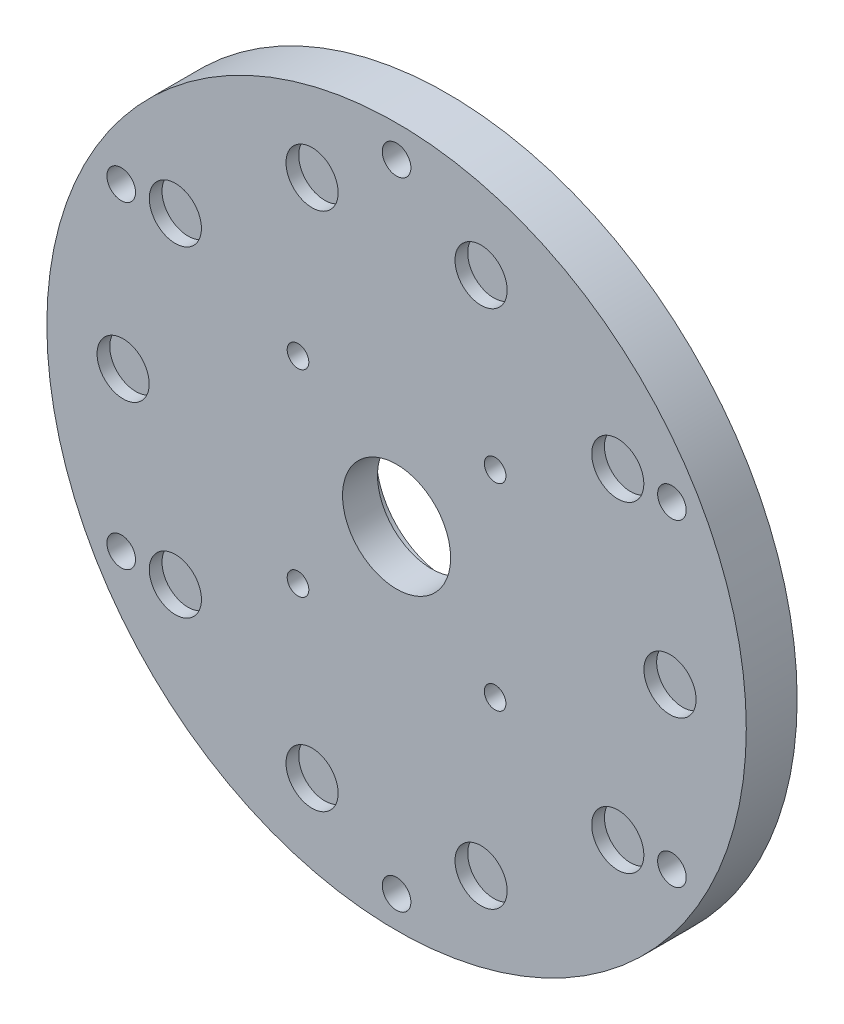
ISO-10303-21;
HEADER;
FILE_DESCRIPTION(('STEP AP214'),'2;1');
FILE_NAME('part.step','',(''),(''),'','','');
FILE_SCHEMA(('AUTOMOTIVE_DESIGN { 1 0 10303 214 1 1 1 1 }'));
ENDSEC;
DATA;
#1=APPLICATION_CONTEXT('core data for automotive mechanical design processes');
#2=APPLICATION_PROTOCOL_DEFINITION('international standard','automotive_design',2000,#1);
#3=PRODUCT_CONTEXT('',#1,'mechanical');
#4=PRODUCT('Part','Part','',(#3));
#5=PRODUCT_RELATED_PRODUCT_CATEGORY('part','',(#4));
#6=PRODUCT_DEFINITION_FORMATION('','',#4);
#7=PRODUCT_DEFINITION_CONTEXT('part definition',#1,'design');
#8=PRODUCT_DEFINITION('design','',#6,#7);
#9=PRODUCT_DEFINITION_SHAPE('','',#8);
#10=(LENGTH_UNIT() NAMED_UNIT(*) SI_UNIT(.MILLI.,.METRE.));
#11=(NAMED_UNIT(*) PLANE_ANGLE_UNIT() SI_UNIT($,.RADIAN.));
#12=(NAMED_UNIT(*) SI_UNIT($,.STERADIAN.) SOLID_ANGLE_UNIT());
#13=UNCERTAINTY_MEASURE_WITH_UNIT(LENGTH_MEASURE(1.E-05),#10,'distance_accuracy_value','');
#14=(GEOMETRIC_REPRESENTATION_CONTEXT(3) GLOBAL_UNCERTAINTY_ASSIGNED_CONTEXT((#13)) GLOBAL_UNIT_ASSIGNED_CONTEXT((#10,
#11,#12)) REPRESENTATION_CONTEXT('',''));
#15=CARTESIAN_POINT('',(0.,0.,0.));
#16=DIRECTION('',(0.,0.,1.));
#17=DIRECTION('',(1.,0.,0.));
#18=AXIS2_PLACEMENT_3D('',#15,#16,#17);
#19=CARTESIAN_POINT('',(43.,0.,6.));
#20=DIRECTION('',(0.,0.,1.));
#21=DIRECTION('',(1.,0.,0.));
#22=AXIS2_PLACEMENT_3D('',#19,#20,#21);
#23=PLANE('',#22);
#24=CARTESIAN_POINT('',(13.287730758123,40.895430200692,6.));
#25=DIRECTION('',(0.,0.,1.));
#26=DIRECTION('',(1.,0.,0.));
#27=AXIS2_PLACEMENT_3D('',#24,#25,#26);
#28=CIRCLE('',#27,4.1);
#29=CARTESIAN_POINT('',(17.387730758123,40.895430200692,6.));
#30=VERTEX_POINT('',#29);
#31=EDGE_CURVE('E9',#30,#30,#28,.T.);
#32=ORIENTED_EDGE('',*,*,#31,.T.);
#33=EDGE_LOOP('',(#32));
#34=FACE_BOUND('',#33,.T.);
#35=ADVANCED_FACE('F14',(#34),#23,.T.);
#36=CARTESIAN_POINT('',(43.,0.,6.));
#37=DIRECTION('',(0.,0.,1.));
#38=DIRECTION('',(1.,0.,0.));
#39=AXIS2_PLACEMENT_3D('',#36,#37,#38);
#40=PLANE('',#39);
#41=CARTESIAN_POINT('',(34.787730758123,25.274765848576,6.));
#42=DIRECTION('',(0.,0.,1.));
#43=DIRECTION('',(1.,0.,0.));
#44=AXIS2_PLACEMENT_3D('',#41,#42,#43);
#45=CIRCLE('',#44,4.1);
#46=CARTESIAN_POINT('',(38.887730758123,25.274765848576,6.));
#47=VERTEX_POINT('',#46);
#48=EDGE_CURVE('E21',#47,#47,#45,.T.);
#49=ORIENTED_EDGE('',*,*,#48,.T.);
#50=EDGE_LOOP('',(#49));
#51=FACE_BOUND('',#50,.T.);
#52=ADVANCED_FACE('F277',(#51),#40,.T.);
#53=CARTESIAN_POINT('',(43.,0.,6.));
#54=DIRECTION('',(0.,0.,1.));
#55=DIRECTION('',(1.,0.,0.));
#56=AXIS2_PLACEMENT_3D('',#53,#54,#55);
#57=PLANE('',#56);
#58=CARTESIAN_POINT('',(43.,0.,6.));
#59=DIRECTION('',(0.,0.,1.));
#60=DIRECTION('',(1.,0.,0.));
#61=AXIS2_PLACEMENT_3D('',#58,#59,#60);
#62=CIRCLE('',#61,4.1);
#63=CARTESIAN_POINT('',(47.1,0.,6.));
#64=VERTEX_POINT('',#63);
#65=EDGE_CURVE('E26',#64,#64,#62,.T.);
#66=ORIENTED_EDGE('',*,*,#65,.T.);
#67=EDGE_LOOP('',(#66));
#68=FACE_BOUND('',#67,.T.);
#69=ADVANCED_FACE('F278',(#68),#57,.T.);
#70=CARTESIAN_POINT('',(43.,0.,6.));
#71=DIRECTION('',(0.,0.,1.));
#72=DIRECTION('',(1.,0.,0.));
#73=AXIS2_PLACEMENT_3D('',#70,#71,#72);
#74=PLANE('',#73);
#75=CARTESIAN_POINT('',(-13.28773075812,40.895430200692,6.));
#76=DIRECTION('',(0.,0.,1.));
#77=DIRECTION('',(1.,0.,0.));
#78=AXIS2_PLACEMENT_3D('',#75,#76,#77);
#79=CIRCLE('',#78,4.1);
#80=CARTESIAN_POINT('',(-9.18773075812,40.895430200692,6.));
#81=VERTEX_POINT('',#80);
#82=EDGE_CURVE('E39',#81,#81,#79,.T.);
#83=ORIENTED_EDGE('',*,*,#82,.T.);
#84=EDGE_LOOP('',(#83));
#85=FACE_BOUND('',#84,.T.);
#86=ADVANCED_FACE('F283',(#85),#74,.T.);
#87=CARTESIAN_POINT('',(43.,0.,6.));
#88=DIRECTION('',(0.,0.,1.));
#89=DIRECTION('',(1.,0.,0.));
#90=AXIS2_PLACEMENT_3D('',#87,#88,#89);
#91=PLANE('',#90);
#92=CARTESIAN_POINT('',(-34.78773075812,25.274765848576,6.));
#93=DIRECTION('',(0.,0.,1.));
#94=DIRECTION('',(1.,0.,0.));
#95=AXIS2_PLACEMENT_3D('',#92,#93,#94);
#96=CIRCLE('',#95,4.1);
#97=CARTESIAN_POINT('',(-30.68773075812,25.274765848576,6.));
#98=VERTEX_POINT('',#97);
#99=EDGE_CURVE('E45',#98,#98,#96,.T.);
#100=ORIENTED_EDGE('',*,*,#99,.T.);
#101=EDGE_LOOP('',(#100));
#102=FACE_BOUND('',#101,.T.);
#103=ADVANCED_FACE('F289',(#102),#91,.T.);
#104=CARTESIAN_POINT('',(43.,0.,6.));
#105=DIRECTION('',(0.,0.,1.));
#106=DIRECTION('',(1.,0.,0.));
#107=AXIS2_PLACEMENT_3D('',#104,#105,#106);
#108=PLANE('',#107);
#109=CARTESIAN_POINT('',(-43.,0.,6.));
#110=DIRECTION('',(0.,0.,1.));
#111=DIRECTION('',(1.,0.,0.));
#112=AXIS2_PLACEMENT_3D('',#109,#110,#111);
#113=CIRCLE('',#112,4.1);
#114=CARTESIAN_POINT('',(-38.9,0.,6.));
#115=VERTEX_POINT('',#114);
#116=EDGE_CURVE('E46',#115,#115,#113,.T.);
#117=ORIENTED_EDGE('',*,*,#116,.T.);
#118=EDGE_LOOP('',(#117));
#119=FACE_BOUND('',#118,.T.);
#120=ADVANCED_FACE('F292',(#119),#108,.T.);
#121=CARTESIAN_POINT('',(43.,0.,6.));
#122=DIRECTION('',(0.,0.,1.));
#123=DIRECTION('',(1.,0.,0.));
#124=AXIS2_PLACEMENT_3D('',#121,#122,#123);
#125=PLANE('',#124);
#126=CARTESIAN_POINT('',(34.787730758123,-25.27476584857,6.));
#127=DIRECTION('',(0.,0.,1.));
#128=DIRECTION('',(1.,0.,0.));
#129=AXIS2_PLACEMENT_3D('',#126,#127,#128);
#130=CIRCLE('',#129,4.1);
#131=CARTESIAN_POINT('',(38.887730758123,-25.27476584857,6.));
#132=VERTEX_POINT('',#131);
#133=EDGE_CURVE('E49',#132,#132,#130,.T.);
#134=ORIENTED_EDGE('',*,*,#133,.T.);
#135=EDGE_LOOP('',(#134));
#136=FACE_BOUND('',#135,.T.);
#137=ADVANCED_FACE('F299',(#136),#125,.T.);
#138=CARTESIAN_POINT('',(43.,0.,6.));
#139=DIRECTION('',(0.,0.,1.));
#140=DIRECTION('',(1.,0.,0.));
#141=AXIS2_PLACEMENT_3D('',#138,#139,#140);
#142=PLANE('',#141);
#143=CARTESIAN_POINT('',(13.287730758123,-40.89543020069,6.));
#144=DIRECTION('',(0.,0.,1.));
#145=DIRECTION('',(1.,0.,0.));
#146=AXIS2_PLACEMENT_3D('',#143,#144,#145);
#147=CIRCLE('',#146,4.1);
#148=CARTESIAN_POINT('',(17.387730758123,-40.89543020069,6.));
#149=VERTEX_POINT('',#148);
#150=EDGE_CURVE('E51',#149,#149,#147,.T.);
#151=ORIENTED_EDGE('',*,*,#150,.T.);
#152=EDGE_LOOP('',(#151));
#153=FACE_BOUND('',#152,.T.);
#154=ADVANCED_FACE('F296',(#153),#142,.T.);
#155=CARTESIAN_POINT('',(43.,0.,6.));
#156=DIRECTION('',(0.,0.,1.));
#157=DIRECTION('',(1.,0.,0.));
#158=AXIS2_PLACEMENT_3D('',#155,#156,#157);
#159=PLANE('',#158);
#160=CARTESIAN_POINT('',(-34.78773075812,-25.27476584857,6.));
#161=DIRECTION('',(0.,0.,1.));
#162=DIRECTION('',(1.,0.,0.));
#163=AXIS2_PLACEMENT_3D('',#160,#161,#162);
#164=CIRCLE('',#163,4.1);
#165=CARTESIAN_POINT('',(-30.68773075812,-25.27476584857,6.));
#166=VERTEX_POINT('',#165);
#167=EDGE_CURVE('E54',#166,#166,#164,.T.);
#168=ORIENTED_EDGE('',*,*,#167,.T.);
#169=EDGE_LOOP('',(#168));
#170=FACE_BOUND('',#169,.T.);
#171=ADVANCED_FACE('F298',(#170),#159,.T.);
#172=CARTESIAN_POINT('',(43.,0.,6.));
#173=DIRECTION('',(0.,0.,1.));
#174=DIRECTION('',(1.,0.,0.));
#175=AXIS2_PLACEMENT_3D('',#172,#173,#174);
#176=PLANE('',#175);
#177=CARTESIAN_POINT('',(-13.28773075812,-40.89543020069,6.));
#178=DIRECTION('',(0.,0.,1.));
#179=DIRECTION('',(1.,0.,0.));
#180=AXIS2_PLACEMENT_3D('',#177,#178,#179);
#181=CIRCLE('',#180,4.1);
#182=CARTESIAN_POINT('',(-9.18773075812,-40.89543020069,6.));
#183=VERTEX_POINT('',#182);
#184=EDGE_CURVE('E56',#183,#183,#181,.T.);
#185=ORIENTED_EDGE('',*,*,#184,.T.);
#186=EDGE_LOOP('',(#185));
#187=FACE_BOUND('',#186,.T.);
#188=ADVANCED_FACE('F305',(#187),#176,.T.);
#189=CARTESIAN_POINT('',(0.,0.,2.5));
#190=DIRECTION('',(0.,0.,1.));
#191=DIRECTION('',(1.,0.,0.));
#192=AXIS2_PLACEMENT_3D('',#189,#190,#191);
#193=PLANE('',#192);
#194=CARTESIAN_POINT('',(0.,0.,2.5));
#195=DIRECTION('',(0.,0.,-1.));
#196=DIRECTION('',(1.,0.,0.));
#197=AXIS2_PLACEMENT_3D('',#194,#195,#196);
#198=CIRCLE('',#197,8.5);
#199=CARTESIAN_POINT('',(8.5,0.,2.5));
#200=VERTEX_POINT('',#199);
#201=EDGE_CURVE('E38',#200,#200,#198,.T.);
#202=ORIENTED_EDGE('',*,*,#201,.F.);
#203=EDGE_LOOP('',(#202));
#204=FACE_BOUND('',#203,.T.);
#205=CARTESIAN_POINT('',(0.,0.,2.5));
#206=DIRECTION('',(0.,0.,1.));
#207=DIRECTION('',(1.,0.,0.));
#208=AXIS2_PLACEMENT_3D('',#205,#206,#207);
#209=CIRCLE('',#208,11.2);
#210=CARTESIAN_POINT('',(11.2,0.,2.5));
#211=VERTEX_POINT('',#210);
#212=EDGE_CURVE('E64',#211,#211,#209,.T.);
#213=ORIENTED_EDGE('',*,*,#212,.F.);
#214=EDGE_LOOP('',(#213));
#215=FACE_BOUND('',#214,.T.);
#216=ADVANCED_FACE('F303',(#204,#215),#193,.F.);
#217=CARTESIAN_POINT('',(13.287730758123,40.895430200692,6.));
#218=DIRECTION('',(0.,0.,-1.));
#219=DIRECTION('',(1.,0.,0.));
#220=AXIS2_PLACEMENT_3D('',#217,#218,#219);
#221=CYLINDRICAL_SURFACE('',#220,4.1);
#222=CARTESIAN_POINT('',(13.287730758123,40.895430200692,8.));
#223=DIRECTION('',(0.,0.,1.));
#224=DIRECTION('',(1.,0.,0.));
#225=AXIS2_PLACEMENT_3D('',#222,#223,#224);
#226=CIRCLE('',#225,4.1);
#227=CARTESIAN_POINT('',(17.387730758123,40.895430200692,8.));
#228=VERTEX_POINT('',#227);
#229=EDGE_CURVE('E70',#228,#228,#226,.T.);
#230=ORIENTED_EDGE('',*,*,#229,.T.);
#231=EDGE_LOOP('',(#230));
#232=FACE_BOUND('',#231,.T.);
#233=ORIENTED_EDGE('',*,*,#31,.F.);
#234=EDGE_LOOP('',(#233));
#235=FACE_BOUND('',#234,.T.);
#236=ADVANCED_FACE('F310',(#232,#235),#221,.F.);
#237=CARTESIAN_POINT('',(34.787730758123,25.274765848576,6.));
#238=DIRECTION('',(0.,0.,-1.));
#239=DIRECTION('',(1.,0.,0.));
#240=AXIS2_PLACEMENT_3D('',#237,#238,#239);
#241=CYLINDRICAL_SURFACE('',#240,4.1);
#242=CARTESIAN_POINT('',(34.787730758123,25.274765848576,8.));
#243=DIRECTION('',(0.,0.,1.));
#244=DIRECTION('',(1.,0.,0.));
#245=AXIS2_PLACEMENT_3D('',#242,#243,#244);
#246=CIRCLE('',#245,4.1);
#247=CARTESIAN_POINT('',(38.887730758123,25.274765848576,8.));
#248=VERTEX_POINT('',#247);
#249=EDGE_CURVE('E76',#248,#248,#246,.T.);
#250=ORIENTED_EDGE('',*,*,#249,.T.);
#251=EDGE_LOOP('',(#250));
#252=FACE_BOUND('',#251,.T.);
#253=ORIENTED_EDGE('',*,*,#48,.F.);
#254=EDGE_LOOP('',(#253));
#255=FACE_BOUND('',#254,.T.);
#256=ADVANCED_FACE('F311',(#252,#255),#241,.F.);
#257=CARTESIAN_POINT('',(43.,0.,6.));
#258=DIRECTION('',(0.,0.,-1.));
#259=DIRECTION('',(1.,0.,0.));
#260=AXIS2_PLACEMENT_3D('',#257,#258,#259);
#261=CYLINDRICAL_SURFACE('',#260,4.1);
#262=CARTESIAN_POINT('',(43.,0.,8.));
#263=DIRECTION('',(0.,0.,1.));
#264=DIRECTION('',(1.,0.,0.));
#265=AXIS2_PLACEMENT_3D('',#262,#263,#264);
#266=CIRCLE('',#265,4.1);
#267=CARTESIAN_POINT('',(47.1,0.,8.));
#268=VERTEX_POINT('',#267);
#269=EDGE_CURVE('E79',#268,#268,#266,.T.);
#270=ORIENTED_EDGE('',*,*,#269,.T.);
#271=EDGE_LOOP('',(#270));
#272=FACE_BOUND('',#271,.T.);
#273=ORIENTED_EDGE('',*,*,#65,.F.);
#274=EDGE_LOOP('',(#273));
#275=FACE_BOUND('',#274,.T.);
#276=ADVANCED_FACE('F320',(#272,#275),#261,.F.);
#277=CARTESIAN_POINT('',(0.,0.,0.));
#278=DIRECTION('',(0.,0.,-1.));
#279=DIRECTION('',(1.,0.,0.));
#280=AXIS2_PLACEMENT_3D('',#277,#278,#279);
#281=CYLINDRICAL_SURFACE('',#280,8.5);
#282=CARTESIAN_POINT('',(0.,0.,8.));
#283=DIRECTION('',(0.,0.,1.));
#284=DIRECTION('',(1.,0.,0.));
#285=AXIS2_PLACEMENT_3D('',#282,#283,#284);
#286=CIRCLE('',#285,8.5);
#287=CARTESIAN_POINT('',(8.5,0.,8.));
#288=VERTEX_POINT('',#287);
#289=EDGE_CURVE('E86',#288,#288,#286,.T.);
#290=ORIENTED_EDGE('',*,*,#289,.T.);
#291=EDGE_LOOP('',(#290));
#292=FACE_BOUND('',#291,.T.);
#293=ORIENTED_EDGE('',*,*,#201,.T.);
#294=EDGE_LOOP('',(#293));
#295=FACE_BOUND('',#294,.T.);
#296=ADVANCED_FACE('F321',(#292,#295),#281,.F.);
#297=CARTESIAN_POINT('',(-13.28773075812,40.895430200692,6.));
#298=DIRECTION('',(0.,0.,-1.));
#299=DIRECTION('',(1.,0.,0.));
#300=AXIS2_PLACEMENT_3D('',#297,#298,#299);
#301=CYLINDRICAL_SURFACE('',#300,4.1);
#302=CARTESIAN_POINT('',(-13.28773075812,40.895430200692,8.));
#303=DIRECTION('',(0.,0.,1.));
#304=DIRECTION('',(1.,0.,0.));
#305=AXIS2_PLACEMENT_3D('',#302,#303,#304);
#306=CIRCLE('',#305,4.1);
#307=CARTESIAN_POINT('',(-9.18773075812,40.895430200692,8.));
#308=VERTEX_POINT('',#307);
#309=EDGE_CURVE('E95',#308,#308,#306,.T.);
#310=ORIENTED_EDGE('',*,*,#309,.T.);
#311=EDGE_LOOP('',(#310));
#312=FACE_BOUND('',#311,.T.);
#313=ORIENTED_EDGE('',*,*,#82,.F.);
#314=EDGE_LOOP('',(#313));
#315=FACE_BOUND('',#314,.T.);
#316=ADVANCED_FACE('F324',(#312,#315),#301,.F.);
#317=CARTESIAN_POINT('',(-34.78773075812,25.274765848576,6.));
#318=DIRECTION('',(0.,0.,-1.));
#319=DIRECTION('',(1.,0.,0.));
#320=AXIS2_PLACEMENT_3D('',#317,#318,#319);
#321=CYLINDRICAL_SURFACE('',#320,4.1);
#322=CARTESIAN_POINT('',(-34.78773075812,25.274765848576,8.));
#323=DIRECTION('',(0.,0.,1.));
#324=DIRECTION('',(1.,0.,0.));
#325=AXIS2_PLACEMENT_3D('',#322,#323,#324);
#326=CIRCLE('',#325,4.1);
#327=CARTESIAN_POINT('',(-30.68773075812,25.274765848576,8.));
#328=VERTEX_POINT('',#327);
#329=EDGE_CURVE('E99',#328,#328,#326,.T.);
#330=ORIENTED_EDGE('',*,*,#329,.T.);
#331=EDGE_LOOP('',(#330));
#332=FACE_BOUND('',#331,.T.);
#333=ORIENTED_EDGE('',*,*,#99,.F.);
#334=EDGE_LOOP('',(#333));
#335=FACE_BOUND('',#334,.T.);
#336=ADVANCED_FACE('F328',(#332,#335),#321,.F.);
#337=CARTESIAN_POINT('',(-43.,0.,6.));
#338=DIRECTION('',(0.,0.,-1.));
#339=DIRECTION('',(1.,0.,0.));
#340=AXIS2_PLACEMENT_3D('',#337,#338,#339);
#341=CYLINDRICAL_SURFACE('',#340,4.1);
#342=CARTESIAN_POINT('',(-43.,0.,8.));
#343=DIRECTION('',(0.,0.,1.));
#344=DIRECTION('',(1.,0.,0.));
#345=AXIS2_PLACEMENT_3D('',#342,#343,#344);
#346=CIRCLE('',#345,4.1);
#347=CARTESIAN_POINT('',(-38.9,0.,8.));
#348=VERTEX_POINT('',#347);
#349=EDGE_CURVE('E107',#348,#348,#346,.T.);
#350=ORIENTED_EDGE('',*,*,#349,.T.);
#351=EDGE_LOOP('',(#350));
#352=FACE_BOUND('',#351,.T.);
#353=ORIENTED_EDGE('',*,*,#116,.F.);
#354=EDGE_LOOP('',(#353));
#355=FACE_BOUND('',#354,.T.);
#356=ADVANCED_FACE('F334',(#352,#355),#341,.F.);
#357=CARTESIAN_POINT('',(34.787730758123,-25.27476584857,6.));
#358=DIRECTION('',(0.,0.,-1.));
#359=DIRECTION('',(1.,0.,0.));
#360=AXIS2_PLACEMENT_3D('',#357,#358,#359);
#361=CYLINDRICAL_SURFACE('',#360,4.1);
#362=CARTESIAN_POINT('',(34.787730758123,-25.27476584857,8.));
#363=DIRECTION('',(0.,0.,1.));
#364=DIRECTION('',(1.,0.,0.));
#365=AXIS2_PLACEMENT_3D('',#362,#363,#364);
#366=CIRCLE('',#365,4.1);
#367=CARTESIAN_POINT('',(38.887730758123,-25.27476584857,8.));
#368=VERTEX_POINT('',#367);
#369=EDGE_CURVE('E114',#368,#368,#366,.T.);
#370=ORIENTED_EDGE('',*,*,#369,.T.);
#371=EDGE_LOOP('',(#370));
#372=FACE_BOUND('',#371,.T.);
#373=ORIENTED_EDGE('',*,*,#133,.F.);
#374=EDGE_LOOP('',(#373));
#375=FACE_BOUND('',#374,.T.);
#376=ADVANCED_FACE('F337',(#372,#375),#361,.F.);
#377=CARTESIAN_POINT('',(13.287730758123,-40.89543020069,6.));
#378=DIRECTION('',(0.,0.,-1.));
#379=DIRECTION('',(1.,0.,0.));
#380=AXIS2_PLACEMENT_3D('',#377,#378,#379);
#381=CYLINDRICAL_SURFACE('',#380,4.1);
#382=CARTESIAN_POINT('',(13.287730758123,-40.89543020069,8.));
#383=DIRECTION('',(0.,0.,1.));
#384=DIRECTION('',(1.,0.,0.));
#385=AXIS2_PLACEMENT_3D('',#382,#383,#384);
#386=CIRCLE('',#385,4.1);
#387=CARTESIAN_POINT('',(17.387730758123,-40.89543020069,8.));
#388=VERTEX_POINT('',#387);
#389=EDGE_CURVE('E122',#388,#388,#386,.T.);
#390=ORIENTED_EDGE('',*,*,#389,.T.);
#391=EDGE_LOOP('',(#390));
#392=FACE_BOUND('',#391,.T.);
#393=ORIENTED_EDGE('',*,*,#150,.F.);
#394=EDGE_LOOP('',(#393));
#395=FACE_BOUND('',#394,.T.);
#396=ADVANCED_FACE('F341',(#392,#395),#381,.F.);
#397=CARTESIAN_POINT('',(-34.78773075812,-25.27476584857,6.));
#398=DIRECTION('',(0.,0.,-1.));
#399=DIRECTION('',(1.,0.,0.));
#400=AXIS2_PLACEMENT_3D('',#397,#398,#399);
#401=CYLINDRICAL_SURFACE('',#400,4.1);
#402=CARTESIAN_POINT('',(-34.78773075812,-25.27476584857,8.));
#403=DIRECTION('',(0.,0.,1.));
#404=DIRECTION('',(1.,0.,0.));
#405=AXIS2_PLACEMENT_3D('',#402,#403,#404);
#406=CIRCLE('',#405,4.1);
#407=CARTESIAN_POINT('',(-30.68773075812,-25.27476584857,8.));
#408=VERTEX_POINT('',#407);
#409=EDGE_CURVE('E135',#408,#408,#406,.T.);
#410=ORIENTED_EDGE('',*,*,#409,.T.);
#411=EDGE_LOOP('',(#410));
#412=FACE_BOUND('',#411,.T.);
#413=ORIENTED_EDGE('',*,*,#167,.F.);
#414=EDGE_LOOP('',(#413));
#415=FACE_BOUND('',#414,.T.);
#416=ADVANCED_FACE('F344',(#412,#415),#401,.F.);
#417=CARTESIAN_POINT('',(-13.28773075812,-40.89543020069,6.));
#418=DIRECTION('',(0.,0.,-1.));
#419=DIRECTION('',(1.,0.,0.));
#420=AXIS2_PLACEMENT_3D('',#417,#418,#419);
#421=CYLINDRICAL_SURFACE('',#420,4.1);
#422=CARTESIAN_POINT('',(-13.28773075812,-40.89543020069,8.));
#423=DIRECTION('',(0.,0.,1.));
#424=DIRECTION('',(1.,0.,0.));
#425=AXIS2_PLACEMENT_3D('',#422,#423,#424);
#426=CIRCLE('',#425,4.1);
#427=CARTESIAN_POINT('',(-9.18773075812,-40.89543020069,8.));
#428=VERTEX_POINT('',#427);
#429=EDGE_CURVE('E145',#428,#428,#426,.T.);
#430=ORIENTED_EDGE('',*,*,#429,.T.);
#431=EDGE_LOOP('',(#430));
#432=FACE_BOUND('',#431,.T.);
#433=ORIENTED_EDGE('',*,*,#184,.F.);
#434=EDGE_LOOP('',(#433));
#435=FACE_BOUND('',#434,.T.);
#436=ADVANCED_FACE('F347',(#432,#435),#421,.F.);
#437=CARTESIAN_POINT('',(0.,50.,0.));
#438=DIRECTION('',(0.,0.,-1.));
#439=DIRECTION('',(1.,0.,0.));
#440=AXIS2_PLACEMENT_3D('',#437,#438,#439);
#441=CYLINDRICAL_SURFACE('',#440,2.25);
#442=CARTESIAN_POINT('',(0.,50.,8.));
#443=DIRECTION('',(0.,0.,1.));
#444=DIRECTION('',(1.,0.,0.));
#445=AXIS2_PLACEMENT_3D('',#442,#443,#444);
#446=CIRCLE('',#445,2.25);
#447=CARTESIAN_POINT('',(2.25,50.,8.));
#448=VERTEX_POINT('',#447);
#449=EDGE_CURVE('E75',#448,#448,#446,.T.);
#450=ORIENTED_EDGE('',*,*,#449,.T.);
#451=EDGE_LOOP('',(#450));
#452=FACE_BOUND('',#451,.T.);
#453=CARTESIAN_POINT('',(0.,50.,0.));
#454=DIRECTION('',(0.,0.,1.));
#455=DIRECTION('',(1.,0.,0.));
#456=AXIS2_PLACEMENT_3D('',#453,#454,#455);
#457=CIRCLE('',#456,2.25);
#458=CARTESIAN_POINT('',(2.25,50.,0.));
#459=VERTEX_POINT('',#458);
#460=EDGE_CURVE('E150',#459,#459,#457,.T.);
#461=ORIENTED_EDGE('',*,*,#460,.F.);
#462=EDGE_LOOP('',(#461));
#463=FACE_BOUND('',#462,.T.);
#464=ADVANCED_FACE('F211',(#452,#463),#441,.F.);
#465=CARTESIAN_POINT('',(43.301270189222,25.,0.));
#466=DIRECTION('',(0.,0.,-1.));
#467=DIRECTION('',(1.,0.,0.));
#468=AXIS2_PLACEMENT_3D('',#465,#466,#467);
#469=CYLINDRICAL_SURFACE('',#468,2.25);
#470=CARTESIAN_POINT('',(43.301270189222,25.,8.));
#471=DIRECTION('',(0.,0.,1.));
#472=DIRECTION('',(1.,0.,0.));
#473=AXIS2_PLACEMENT_3D('',#470,#471,#472);
#474=CIRCLE('',#473,2.25);
#475=CARTESIAN_POINT('',(45.551270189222,25.,8.));
#476=VERTEX_POINT('',#475);
#477=EDGE_CURVE('E71',#476,#476,#474,.T.);
#478=ORIENTED_EDGE('',*,*,#477,.T.);
#479=EDGE_LOOP('',(#478));
#480=FACE_BOUND('',#479,.T.);
#481=CARTESIAN_POINT('',(43.301270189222,25.,0.));
#482=DIRECTION('',(0.,0.,1.));
#483=DIRECTION('',(1.,0.,0.));
#484=AXIS2_PLACEMENT_3D('',#481,#482,#483);
#485=CIRCLE('',#484,2.25);
#486=CARTESIAN_POINT('',(45.551270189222,25.,0.));
#487=VERTEX_POINT('',#486);
#488=EDGE_CURVE('E155',#487,#487,#485,.T.);
#489=ORIENTED_EDGE('',*,*,#488,.F.);
#490=EDGE_LOOP('',(#489));
#491=FACE_BOUND('',#490,.T.);
#492=ADVANCED_FACE('F353',(#480,#491),#469,.F.);
#493=CARTESIAN_POINT('',(15.5,15.5,0.));
#494=DIRECTION('',(0.,0.,-1.));
#495=DIRECTION('',(1.,0.,0.));
#496=AXIS2_PLACEMENT_3D('',#493,#494,#495);
#497=CYLINDRICAL_SURFACE('',#496,1.7);
#498=CARTESIAN_POINT('',(15.5,15.5,8.));
#499=DIRECTION('',(0.,0.,1.));
#500=DIRECTION('',(1.,0.,0.));
#501=AXIS2_PLACEMENT_3D('',#498,#499,#500);
#502=CIRCLE('',#501,1.7);
#503=CARTESIAN_POINT('',(17.2,15.5,8.));
#504=VERTEX_POINT('',#503);
#505=EDGE_CURVE('E81',#504,#504,#502,.T.);
#506=ORIENTED_EDGE('',*,*,#505,.T.);
#507=EDGE_LOOP('',(#506));
#508=FACE_BOUND('',#507,.T.);
#509=CARTESIAN_POINT('',(15.5,15.5,0.));
#510=DIRECTION('',(0.,0.,1.));
#511=DIRECTION('',(1.,0.,0.));
#512=AXIS2_PLACEMENT_3D('',#509,#510,#511);
#513=CIRCLE('',#512,1.7);
#514=CARTESIAN_POINT('',(17.2,15.5,0.));
#515=VERTEX_POINT('',#514);
#516=EDGE_CURVE('E156',#515,#515,#513,.T.);
#517=ORIENTED_EDGE('',*,*,#516,.F.);
#518=EDGE_LOOP('',(#517));
#519=FACE_BOUND('',#518,.T.);
#520=ADVANCED_FACE('F360',(#508,#519),#497,.F.);
#521=CARTESIAN_POINT('',(0.,0.,0.));
#522=DIRECTION('',(0.,0.,-1.));
#523=DIRECTION('',(1.,0.,0.));
#524=AXIS2_PLACEMENT_3D('',#521,#522,#523);
#525=CYLINDRICAL_SURFACE('',#524,11.2);
#526=ORIENTED_EDGE('',*,*,#212,.T.);
#527=EDGE_LOOP('',(#526));
#528=FACE_BOUND('',#527,.T.);
#529=CARTESIAN_POINT('',(0.,0.,0.));
#530=DIRECTION('',(0.,0.,1.));
#531=DIRECTION('',(1.,0.,0.));
#532=AXIS2_PLACEMENT_3D('',#529,#530,#531);
#533=CIRCLE('',#532,11.2);
#534=CARTESIAN_POINT('',(11.2,0.,0.));
#535=VERTEX_POINT('',#534);
#536=EDGE_CURVE('E161',#535,#535,#533,.T.);
#537=ORIENTED_EDGE('',*,*,#536,.F.);
#538=EDGE_LOOP('',(#537));
#539=FACE_BOUND('',#538,.T.);
#540=ADVANCED_FACE('F363',(#528,#539),#525,.F.);
#541=CARTESIAN_POINT('',(-15.5,15.5,0.));
#542=DIRECTION('',(0.,0.,-1.));
#543=DIRECTION('',(1.,0.,0.));
#544=AXIS2_PLACEMENT_3D('',#541,#542,#543);
#545=CYLINDRICAL_SURFACE('',#544,1.7);
#546=CARTESIAN_POINT('',(-15.5,15.5,8.));
#547=DIRECTION('',(0.,0.,1.));
#548=DIRECTION('',(1.,0.,0.));
#549=AXIS2_PLACEMENT_3D('',#546,#547,#548);
#550=CIRCLE('',#549,1.7);
#551=CARTESIAN_POINT('',(-13.8,15.5,8.));
#552=VERTEX_POINT('',#551);
#553=EDGE_CURVE('E96',#552,#552,#550,.T.);
#554=ORIENTED_EDGE('',*,*,#553,.T.);
#555=EDGE_LOOP('',(#554));
#556=FACE_BOUND('',#555,.T.);
#557=CARTESIAN_POINT('',(-15.5,15.5,0.));
#558=DIRECTION('',(0.,0.,1.));
#559=DIRECTION('',(1.,0.,0.));
#560=AXIS2_PLACEMENT_3D('',#557,#558,#559);
#561=CIRCLE('',#560,1.7);
#562=CARTESIAN_POINT('',(-13.8,15.5,0.));
#563=VERTEX_POINT('',#562);
#564=EDGE_CURVE('E160',#563,#563,#561,.T.);
#565=ORIENTED_EDGE('',*,*,#564,.F.);
#566=EDGE_LOOP('',(#565));
#567=FACE_BOUND('',#566,.T.);
#568=ADVANCED_FACE('F366',(#556,#567),#545,.F.);
#569=CARTESIAN_POINT('',(-43.30127018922,25.,0.));
#570=DIRECTION('',(0.,0.,-1.));
#571=DIRECTION('',(1.,0.,0.));
#572=AXIS2_PLACEMENT_3D('',#569,#570,#571);
#573=CYLINDRICAL_SURFACE('',#572,2.25);
#574=CARTESIAN_POINT('',(-43.30127018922,25.,8.));
#575=DIRECTION('',(0.,0.,1.));
#576=DIRECTION('',(1.,0.,0.));
#577=AXIS2_PLACEMENT_3D('',#574,#575,#576);
#578=CIRCLE('',#577,2.25);
#579=CARTESIAN_POINT('',(-41.05127018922,25.,8.));
#580=VERTEX_POINT('',#579);
#581=EDGE_CURVE('E102',#580,#580,#578,.T.);
#582=ORIENTED_EDGE('',*,*,#581,.T.);
#583=EDGE_LOOP('',(#582));
#584=FACE_BOUND('',#583,.T.);
#585=CARTESIAN_POINT('',(-43.30127018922,25.,0.));
#586=DIRECTION('',(0.,0.,1.));
#587=DIRECTION('',(1.,0.,0.));
#588=AXIS2_PLACEMENT_3D('',#585,#586,#587);
#589=CIRCLE('',#588,2.25);
#590=CARTESIAN_POINT('',(-41.05127018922,25.,0.));
#591=VERTEX_POINT('',#590);
#592=EDGE_CURVE('E165',#591,#591,#589,.T.);
#593=ORIENTED_EDGE('',*,*,#592,.F.);
#594=EDGE_LOOP('',(#593));
#595=FACE_BOUND('',#594,.T.);
#596=ADVANCED_FACE('F375',(#584,#595),#573,.F.);
#597=CARTESIAN_POINT('',(43.301270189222,-25.,0.));
#598=DIRECTION('',(0.,0.,-1.));
#599=DIRECTION('',(1.,0.,0.));
#600=AXIS2_PLACEMENT_3D('',#597,#598,#599);
#601=CYLINDRICAL_SURFACE('',#600,2.25);
#602=CARTESIAN_POINT('',(43.301270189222,-25.,8.));
#603=DIRECTION('',(0.,0.,1.));
#604=DIRECTION('',(1.,0.,0.));
#605=AXIS2_PLACEMENT_3D('',#602,#603,#604);
#606=CIRCLE('',#605,2.25);
#607=CARTESIAN_POINT('',(45.551270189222,-25.,8.));
#608=VERTEX_POINT('',#607);
#609=EDGE_CURVE('E108',#608,#608,#606,.T.);
#610=ORIENTED_EDGE('',*,*,#609,.T.);
#611=EDGE_LOOP('',(#610));
#612=FACE_BOUND('',#611,.T.);
#613=CARTESIAN_POINT('',(43.301270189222,-25.,0.));
#614=DIRECTION('',(0.,0.,1.));
#615=DIRECTION('',(1.,0.,0.));
#616=AXIS2_PLACEMENT_3D('',#613,#614,#615);
#617=CIRCLE('',#616,2.25);
#618=CARTESIAN_POINT('',(45.551270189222,-25.,0.));
#619=VERTEX_POINT('',#618);
#620=EDGE_CURVE('E162',#619,#619,#617,.T.);
#621=ORIENTED_EDGE('',*,*,#620,.F.);
#622=EDGE_LOOP('',(#621));
#623=FACE_BOUND('',#622,.T.);
#624=ADVANCED_FACE('F376',(#612,#623),#601,.F.);
#625=CARTESIAN_POINT('',(15.5,-15.5,0.));
#626=DIRECTION('',(0.,0.,-1.));
#627=DIRECTION('',(1.,0.,0.));
#628=AXIS2_PLACEMENT_3D('',#625,#626,#627);
#629=CYLINDRICAL_SURFACE('',#628,1.7);
#630=CARTESIAN_POINT('',(15.5,-15.5,8.));
#631=DIRECTION('',(0.,0.,1.));
#632=DIRECTION('',(1.,0.,0.));
#633=AXIS2_PLACEMENT_3D('',#630,#631,#632);
#634=CIRCLE('',#633,1.7);
#635=CARTESIAN_POINT('',(17.2,-15.5,8.));
#636=VERTEX_POINT('',#635);
#637=EDGE_CURVE('E120',#636,#636,#634,.T.);
#638=ORIENTED_EDGE('',*,*,#637,.T.);
#639=EDGE_LOOP('',(#638));
#640=FACE_BOUND('',#639,.T.);
#641=CARTESIAN_POINT('',(15.5,-15.5,0.));
#642=DIRECTION('',(0.,0.,1.));
#643=DIRECTION('',(1.,0.,0.));
#644=AXIS2_PLACEMENT_3D('',#641,#642,#643);
#645=CIRCLE('',#644,1.7);
#646=CARTESIAN_POINT('',(17.2,-15.5,0.));
#647=VERTEX_POINT('',#646);
#648=EDGE_CURVE('E170',#647,#647,#645,.T.);
#649=ORIENTED_EDGE('',*,*,#648,.F.);
#650=EDGE_LOOP('',(#649));
#651=FACE_BOUND('',#650,.T.);
#652=ADVANCED_FACE('F378',(#640,#651),#629,.F.);
#653=CARTESIAN_POINT('',(-15.5,-15.5,0.));
#654=DIRECTION('',(0.,0.,-1.));
#655=DIRECTION('',(1.,0.,0.));
#656=AXIS2_PLACEMENT_3D('',#653,#654,#655);
#657=CYLINDRICAL_SURFACE('',#656,1.7);
#658=CARTESIAN_POINT('',(-15.5,-15.5,8.));
#659=DIRECTION('',(0.,0.,1.));
#660=DIRECTION('',(1.,0.,0.));
#661=AXIS2_PLACEMENT_3D('',#658,#659,#660);
#662=CIRCLE('',#661,1.7);
#663=CARTESIAN_POINT('',(-13.8,-15.5,8.));
#664=VERTEX_POINT('',#663);
#665=EDGE_CURVE('E128',#664,#664,#662,.T.);
#666=ORIENTED_EDGE('',*,*,#665,.T.);
#667=EDGE_LOOP('',(#666));
#668=FACE_BOUND('',#667,.T.);
#669=CARTESIAN_POINT('',(-15.5,-15.5,0.));
#670=DIRECTION('',(0.,0.,1.));
#671=DIRECTION('',(1.,0.,0.));
#672=AXIS2_PLACEMENT_3D('',#669,#670,#671);
#673=CIRCLE('',#672,1.7);
#674=CARTESIAN_POINT('',(-13.8,-15.5,0.));
#675=VERTEX_POINT('',#674);
#676=EDGE_CURVE('E171',#675,#675,#673,.T.);
#677=ORIENTED_EDGE('',*,*,#676,.F.);
#678=EDGE_LOOP('',(#677));
#679=FACE_BOUND('',#678,.T.);
#680=ADVANCED_FACE('F381',(#668,#679),#657,.F.);
#681=CARTESIAN_POINT('',(-43.30127018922,-25.,0.));
#682=DIRECTION('',(0.,0.,-1.));
#683=DIRECTION('',(1.,0.,0.));
#684=AXIS2_PLACEMENT_3D('',#681,#682,#683);
#685=CYLINDRICAL_SURFACE('',#684,2.25);
#686=CARTESIAN_POINT('',(-43.30127018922,-25.,8.));
#687=DIRECTION('',(0.,0.,1.));
#688=DIRECTION('',(1.,0.,0.));
#689=AXIS2_PLACEMENT_3D('',#686,#687,#688);
#690=CIRCLE('',#689,2.25);
#691=CARTESIAN_POINT('',(-41.05127018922,-25.,8.));
#692=VERTEX_POINT('',#691);
#693=EDGE_CURVE('E137',#692,#692,#690,.T.);
#694=ORIENTED_EDGE('',*,*,#693,.T.);
#695=EDGE_LOOP('',(#694));
#696=FACE_BOUND('',#695,.T.);
#697=CARTESIAN_POINT('',(-43.30127018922,-25.,0.));
#698=DIRECTION('',(0.,0.,1.));
#699=DIRECTION('',(1.,0.,0.));
#700=AXIS2_PLACEMENT_3D('',#697,#698,#699);
#701=CIRCLE('',#700,2.25);
#702=CARTESIAN_POINT('',(-41.05127018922,-25.,0.));
#703=VERTEX_POINT('',#702);
#704=EDGE_CURVE('E175',#703,#703,#701,.T.);
#705=ORIENTED_EDGE('',*,*,#704,.F.);
#706=EDGE_LOOP('',(#705));
#707=FACE_BOUND('',#706,.T.);
#708=ADVANCED_FACE('F384',(#696,#707),#685,.F.);
#709=CARTESIAN_POINT('',(0.,-50.,0.));
#710=DIRECTION('',(0.,0.,-1.));
#711=DIRECTION('',(1.,0.,0.));
#712=AXIS2_PLACEMENT_3D('',#709,#710,#711);
#713=CYLINDRICAL_SURFACE('',#712,2.25);
#714=CARTESIAN_POINT('',(0.,-50.,8.));
#715=DIRECTION('',(0.,0.,1.));
#716=DIRECTION('',(1.,0.,0.));
#717=AXIS2_PLACEMENT_3D('',#714,#715,#716);
#718=CIRCLE('',#717,2.25);
#719=CARTESIAN_POINT('',(2.24999999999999,-50.,8.));
#720=VERTEX_POINT('',#719);
#721=EDGE_CURVE('E138',#720,#720,#718,.T.);
#722=ORIENTED_EDGE('',*,*,#721,.T.);
#723=EDGE_LOOP('',(#722));
#724=FACE_BOUND('',#723,.T.);
#725=CARTESIAN_POINT('',(0.,-50.,0.));
#726=DIRECTION('',(0.,0.,1.));
#727=DIRECTION('',(1.,0.,0.));
#728=AXIS2_PLACEMENT_3D('',#725,#726,#727);
#729=CIRCLE('',#728,2.25);
#730=CARTESIAN_POINT('',(2.24999999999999,-50.,0.));
#731=VERTEX_POINT('',#730);
#732=EDGE_CURVE('E177',#731,#731,#729,.T.);
#733=ORIENTED_EDGE('',*,*,#732,.F.);
#734=EDGE_LOOP('',(#733));
#735=FACE_BOUND('',#734,.T.);
#736=ADVANCED_FACE('F217',(#724,#735),#713,.F.);
#737=CARTESIAN_POINT('',(0.,0.,8.));
#738=DIRECTION('',(0.,0.,1.));
#739=DIRECTION('',(1.,0.,0.));
#740=AXIS2_PLACEMENT_3D('',#737,#738,#739);
#741=PLANE('',#740);
#742=ORIENTED_EDGE('',*,*,#229,.F.);
#743=EDGE_LOOP('',(#742));
#744=FACE_BOUND('',#743,.T.);
#745=ORIENTED_EDGE('',*,*,#449,.F.);
#746=EDGE_LOOP('',(#745));
#747=FACE_BOUND('',#746,.T.);
#748=ORIENTED_EDGE('',*,*,#477,.F.);
#749=EDGE_LOOP('',(#748));
#750=FACE_BOUND('',#749,.T.);
#751=ORIENTED_EDGE('',*,*,#249,.F.);
#752=EDGE_LOOP('',(#751));
#753=FACE_BOUND('',#752,.T.);
#754=ORIENTED_EDGE('',*,*,#269,.F.);
#755=EDGE_LOOP('',(#754));
#756=FACE_BOUND('',#755,.T.);
#757=ORIENTED_EDGE('',*,*,#505,.F.);
#758=EDGE_LOOP('',(#757));
#759=FACE_BOUND('',#758,.T.);
#760=ORIENTED_EDGE('',*,*,#289,.F.);
#761=EDGE_LOOP('',(#760));
#762=FACE_BOUND('',#761,.T.);
#763=ORIENTED_EDGE('',*,*,#309,.F.);
#764=EDGE_LOOP('',(#763));
#765=FACE_BOUND('',#764,.T.);
#766=ORIENTED_EDGE('',*,*,#553,.F.);
#767=EDGE_LOOP('',(#766));
#768=FACE_BOUND('',#767,.T.);
#769=ORIENTED_EDGE('',*,*,#329,.F.);
#770=EDGE_LOOP('',(#769));
#771=FACE_BOUND('',#770,.T.);
#772=ORIENTED_EDGE('',*,*,#581,.F.);
#773=EDGE_LOOP('',(#772));
#774=FACE_BOUND('',#773,.T.);
#775=ORIENTED_EDGE('',*,*,#349,.F.);
#776=EDGE_LOOP('',(#775));
#777=FACE_BOUND('',#776,.T.);
#778=ORIENTED_EDGE('',*,*,#609,.F.);
#779=EDGE_LOOP('',(#778));
#780=FACE_BOUND('',#779,.T.);
#781=ORIENTED_EDGE('',*,*,#369,.F.);
#782=EDGE_LOOP('',(#781));
#783=FACE_BOUND('',#782,.T.);
#784=ORIENTED_EDGE('',*,*,#637,.F.);
#785=EDGE_LOOP('',(#784));
#786=FACE_BOUND('',#785,.T.);
#787=ORIENTED_EDGE('',*,*,#389,.F.);
#788=EDGE_LOOP('',(#787));
#789=FACE_BOUND('',#788,.T.);
#790=ORIENTED_EDGE('',*,*,#665,.F.);
#791=EDGE_LOOP('',(#790));
#792=FACE_BOUND('',#791,.T.);
#793=ORIENTED_EDGE('',*,*,#409,.F.);
#794=EDGE_LOOP('',(#793));
#795=FACE_BOUND('',#794,.T.);
#796=ORIENTED_EDGE('',*,*,#693,.F.);
#797=EDGE_LOOP('',(#796));
#798=FACE_BOUND('',#797,.T.);
#799=ORIENTED_EDGE('',*,*,#721,.F.);
#800=EDGE_LOOP('',(#799));
#801=FACE_BOUND('',#800,.T.);
#802=ORIENTED_EDGE('',*,*,#429,.F.);
#803=EDGE_LOOP('',(#802));
#804=FACE_BOUND('',#803,.T.);
#805=CARTESIAN_POINT('',(0.,0.,8.));
#806=DIRECTION('',(0.,0.,1.));
#807=DIRECTION('',(1.,0.,0.));
#808=AXIS2_PLACEMENT_3D('',#805,#806,#807);
#809=CIRCLE('',#808,55.);
#810=CARTESIAN_POINT('',(55.,0.,8.));
#811=VERTEX_POINT('',#810);
#812=EDGE_CURVE('E183',#811,#811,#809,.T.);
#813=ORIENTED_EDGE('',*,*,#812,.T.);
#814=EDGE_LOOP('',(#813));
#815=FACE_BOUND('',#814,.T.);
#816=ADVANCED_FACE('F212',(#744,#747,#750,#753,#756,#759,#762,#765,#768,#771,#774,#777,#780,
#783,#786,#789,#792,#795,#798,#801,#804,#815),#741,.T.);
#817=CARTESIAN_POINT('',(0.,0.,0.));
#818=DIRECTION('',(0.,0.,1.));
#819=DIRECTION('',(1.,0.,0.));
#820=AXIS2_PLACEMENT_3D('',#817,#818,#819);
#821=PLANE('',#820);
#822=ORIENTED_EDGE('',*,*,#460,.T.);
#823=EDGE_LOOP('',(#822));
#824=FACE_BOUND('',#823,.T.);
#825=ORIENTED_EDGE('',*,*,#488,.T.);
#826=EDGE_LOOP('',(#825));
#827=FACE_BOUND('',#826,.T.);
#828=ORIENTED_EDGE('',*,*,#516,.T.);
#829=EDGE_LOOP('',(#828));
#830=FACE_BOUND('',#829,.T.);
#831=ORIENTED_EDGE('',*,*,#536,.T.);
#832=EDGE_LOOP('',(#831));
#833=FACE_BOUND('',#832,.T.);
#834=ORIENTED_EDGE('',*,*,#564,.T.);
#835=EDGE_LOOP('',(#834));
#836=FACE_BOUND('',#835,.T.);
#837=ORIENTED_EDGE('',*,*,#592,.T.);
#838=EDGE_LOOP('',(#837));
#839=FACE_BOUND('',#838,.T.);
#840=ORIENTED_EDGE('',*,*,#620,.T.);
#841=EDGE_LOOP('',(#840));
#842=FACE_BOUND('',#841,.T.);
#843=ORIENTED_EDGE('',*,*,#648,.T.);
#844=EDGE_LOOP('',(#843));
#845=FACE_BOUND('',#844,.T.);
#846=ORIENTED_EDGE('',*,*,#676,.T.);
#847=EDGE_LOOP('',(#846));
#848=FACE_BOUND('',#847,.T.);
#849=ORIENTED_EDGE('',*,*,#704,.T.);
#850=EDGE_LOOP('',(#849));
#851=FACE_BOUND('',#850,.T.);
#852=ORIENTED_EDGE('',*,*,#732,.T.);
#853=EDGE_LOOP('',(#852));
#854=FACE_BOUND('',#853,.T.);
#855=CARTESIAN_POINT('',(0.,0.,0.));
#856=DIRECTION('',(0.,0.,1.));
#857=DIRECTION('',(1.,0.,0.));
#858=AXIS2_PLACEMENT_3D('',#855,#856,#857);
#859=CIRCLE('',#858,55.);
#860=CARTESIAN_POINT('',(55.,0.,0.));
#861=VERTEX_POINT('',#860);
#862=EDGE_CURVE('E194',#861,#861,#859,.T.);
#863=ORIENTED_EDGE('',*,*,#862,.F.);
#864=EDGE_LOOP('',(#863));
#865=FACE_BOUND('',#864,.T.);
#866=ADVANCED_FACE('F220',(#824,#827,#830,#833,#836,#839,#842,#845,#848,#851,#854,#865),#821,.F.);
#867=CARTESIAN_POINT('',(0.,0.,0.));
#868=DIRECTION('',(0.,0.,-1.));
#869=DIRECTION('',(1.,0.,0.));
#870=AXIS2_PLACEMENT_3D('',#867,#868,#869);
#871=CYLINDRICAL_SURFACE('',#870,55.);
#872=ORIENTED_EDGE('',*,*,#812,.F.);
#873=EDGE_LOOP('',(#872));
#874=FACE_BOUND('',#873,.T.);
#875=ORIENTED_EDGE('',*,*,#862,.T.);
#876=EDGE_LOOP('',(#875));
#877=FACE_BOUND('',#876,.T.);
#878=ADVANCED_FACE('F261',(#874,#877),#871,.T.);
#879=CLOSED_SHELL('',(#35,#52,#69,#86,#103,#120,#137,#154,#171,#188,#216,#236,#256,#276,#296,
#316,#336,#356,#376,#396,#416,#436,#464,#492,#520,#540,#568,#596,#624,#652,#680,#708,#736,#816,
#866,#878));
#880=MANIFOLD_SOLID_BREP('B1',#879);
#881=ADVANCED_BREP_SHAPE_REPRESENTATION('',(#18,#880),#14);
#882=SHAPE_DEFINITION_REPRESENTATION(#9,#881);
ENDSEC;
END-ISO-10303-21;
